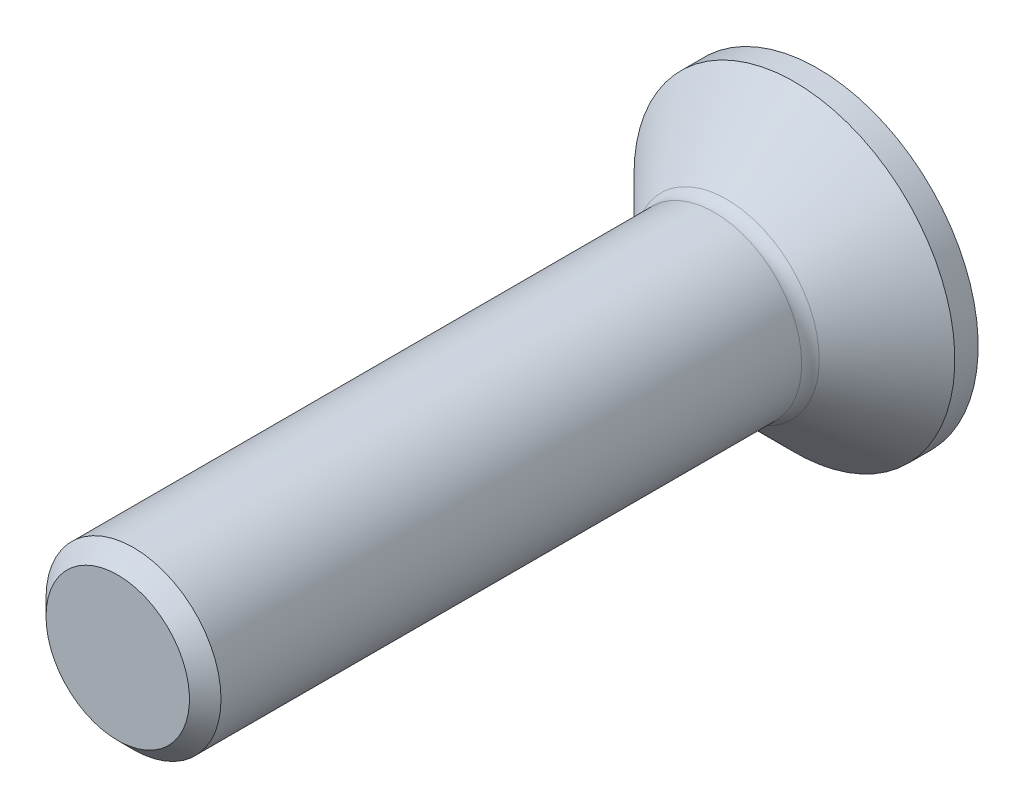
from build123d import *

# Parameters (mm, degrees)
CHAMFER1_SIZE      = 0.270625
FILLET1_R          = 0.3
SKETCH2_OUTSIDE_W  = 11.29
SKETCH2_OUTSIDE_H  = 11.29
SKETCH2_OUTSIDE_R  = 2.75
CUT_EXTRUDE1_DEPTH = 13.80019536
HOLE1_D            = 2
HOLE1_DEPTH        = 1.05
HOLE1_TIP          = 0.577350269
CUT_EXTRUDE2_DEPTH = 1.05


with BuildPart() as part:
    # Sketch1 → Base-Revolve (revolve)
    with BuildSketch(Plane(origin=(0, 0, 0), x_dir=(0, 0, -1), z_dir=(1, 0, 0)), mode=Mode.PRIVATE) as base_revolve_sk:
        Polygon((0, 1.5), (1.65, 3.15), (1.65, 0), (-10.35, 0), (-10.35, 1.5), align=None)
    revolve(base_revolve_sk.sketch.rotate(Axis((0, 0, 10.35), (0, 0, -1)), 90), axis=Axis((0, 0, 10.35), (0, 0, -1)))

    # Chamfer1
    chamfer1_edges = [part.edges().sort_by_distance(p)[0] for p in [
        (-1.5, 0, 10.35),
    ]]
    chamfer(chamfer1_edges, length=CHAMFER1_SIZE)

    # Fillet1
    fillet1_edges = [part.edges().sort_by_distance(p)[0] for p in [
        (-1.5, 0, 0),
    ]]
    fillet(fillet1_edges, radius=FILLET1_R)

    # Sketch2 outside → Cut-Extrude1 (cut, through all)
    with BuildSketch(Plane(origin=(0, 0, -1.65), x_dir=(-1, 0, 0), z_dir=(0, 0, -1))):
        Rectangle(SKETCH2_OUTSIDE_W, SKETCH2_OUTSIDE_H)
        Circle(SKETCH2_OUTSIDE_R, mode=Mode.SUBTRACT)
    extrude(amount=-CUT_EXTRUDE1_DEPTH, mode=Mode.SUBTRACT)

    # Hole1
    with Locations(Plane(origin=(0, 0, -1.65), x_dir=(-1, 0, 0), z_dir=(0, 0, -1))):
        with Locations((0, 0)):
            Hole(HOLE1_D / 2, depth=HOLE1_DEPTH)
            with Locations((0, 0, -(HOLE1_DEPTH + HOLE1_TIP / 2))):  # 120° drill point
                Cone(0, HOLE1_D / 2, HOLE1_TIP, mode=Mode.SUBTRACT)

    # Sketch5 → Cut-Extrude2 (cut)
    with BuildSketch(Plane(origin=(0, 0, -1.65), x_dir=(-1, 0, 0), z_dir=(0, 0, -1))):
        Polygon((-0.577350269, 1), (0.577350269, 1), (1.154700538, 0), (0.577350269, -1), (-0.577350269, -1), (-1.154700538, 0), align=None)
    extrude(amount=-CUT_EXTRUDE2_DEPTH, mode=Mode.SUBTRACT)


solid = part.part
